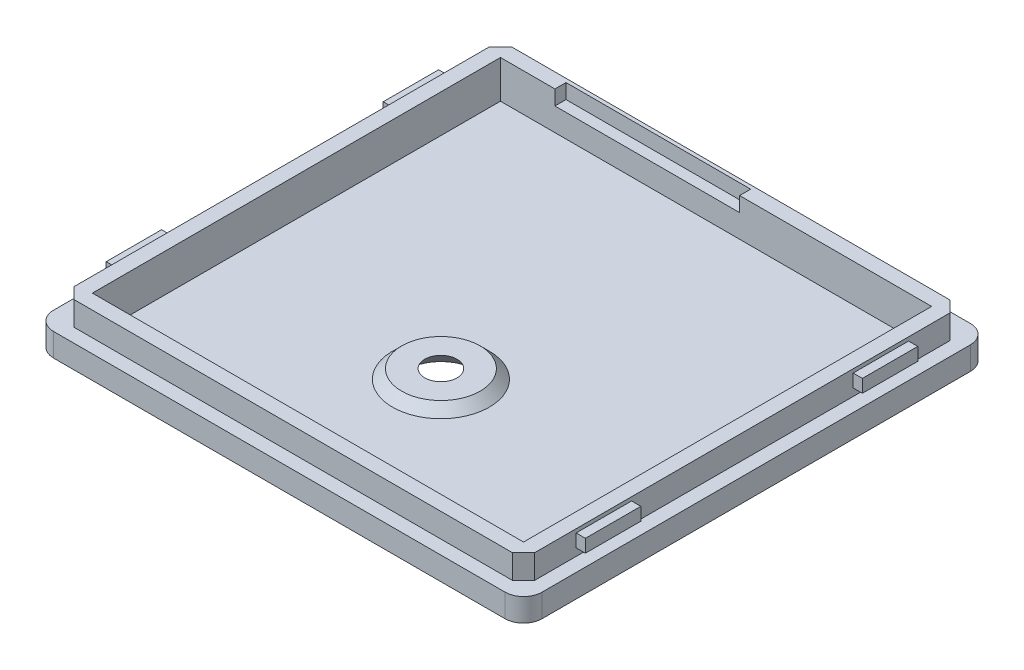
ISO-10303-21;
HEADER;
FILE_DESCRIPTION(('STEP AP214'),'2;1');
FILE_NAME('part.step','',(''),(''),'','','');
FILE_SCHEMA(('AUTOMOTIVE_DESIGN { 1 0 10303 214 1 1 1 1 }'));
ENDSEC;
DATA;
#1=APPLICATION_CONTEXT('core data for automotive mechanical design processes');
#2=APPLICATION_PROTOCOL_DEFINITION('international standard','automotive_design',2000,#1);
#3=PRODUCT_CONTEXT('',#1,'mechanical');
#4=PRODUCT('Part','Part','',(#3));
#5=PRODUCT_RELATED_PRODUCT_CATEGORY('part','',(#4));
#6=PRODUCT_DEFINITION_FORMATION('','',#4);
#7=PRODUCT_DEFINITION_CONTEXT('part definition',#1,'design');
#8=PRODUCT_DEFINITION('design','',#6,#7);
#9=PRODUCT_DEFINITION_SHAPE('','',#8);
#10=(LENGTH_UNIT() NAMED_UNIT(*) SI_UNIT(.MILLI.,.METRE.));
#11=(NAMED_UNIT(*) PLANE_ANGLE_UNIT() SI_UNIT($,.RADIAN.));
#12=(NAMED_UNIT(*) SI_UNIT($,.STERADIAN.) SOLID_ANGLE_UNIT());
#13=UNCERTAINTY_MEASURE_WITH_UNIT(LENGTH_MEASURE(1.E-05),#10,'distance_accuracy_value','');
#14=(GEOMETRIC_REPRESENTATION_CONTEXT(3) GLOBAL_UNCERTAINTY_ASSIGNED_CONTEXT((#13)) GLOBAL_UNIT_ASSIGNED_CONTEXT((#10,
#11,#12)) REPRESENTATION_CONTEXT('',''));
#15=CARTESIAN_POINT('',(0.,0.,0.));
#16=DIRECTION('',(0.,0.,1.));
#17=DIRECTION('',(1.,0.,0.));
#18=AXIS2_PLACEMENT_3D('',#15,#16,#17);
#19=CARTESIAN_POINT('',(-24.95,-70.565518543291,-23.2));
#20=DIRECTION('',(-1.,0.,0.));
#21=DIRECTION('',(0.,0.,1.));
#22=AXIS2_PLACEMENT_3D('',#19,#20,#21);
#23=PLANE('',#22);
#24=DIRECTION('',(0.,1.,0.));
#25=VECTOR('',#24,1.);
#26=CARTESIAN_POINT('',(-24.95,0.802943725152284,22.5));
#27=LINE('',#26,#25);
#28=CARTESIAN_POINT('',(-24.95,2.5,22.5));
#29=VERTEX_POINT('',#28);
#30=CARTESIAN_POINT('',(-24.95,5.1,22.5));
#31=VERTEX_POINT('',#30);
#32=EDGE_CURVE('E1050',#29,#31,#27,.T.);
#33=ORIENTED_EDGE('',*,*,#32,.T.);
#34=DIRECTION('',(0.,0.,1.));
#35=VECTOR('',#34,1.);
#36=CARTESIAN_POINT('',(-24.95,5.1,-23.2));
#37=LINE('',#36,#35);
#38=CARTESIAN_POINT('',(-24.95,5.1,-22.5));
#39=VERTEX_POINT('',#38);
#40=EDGE_CURVE('E1037',#39,#31,#37,.T.);
#41=ORIENTED_EDGE('',*,*,#40,.F.);
#42=DIRECTION('',(0.,1.,0.));
#43=VECTOR('',#42,1.);
#44=CARTESIAN_POINT('',(-24.95,0.802943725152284,-22.5));
#45=LINE('',#44,#43);
#46=CARTESIAN_POINT('',(-24.95,2.5,-22.5));
#47=VERTEX_POINT('',#46);
#48=EDGE_CURVE('E929',#47,#39,#45,.T.);
#49=ORIENTED_EDGE('',*,*,#48,.F.);
#50=DIRECTION('',(0.,0.,1.));
#51=VECTOR('',#50,1.);
#52=CARTESIAN_POINT('',(-24.95,2.5,-23.2));
#53=LINE('',#52,#51);
#54=EDGE_CURVE('E326',#47,#29,#53,.T.);
#55=ORIENTED_EDGE('',*,*,#54,.T.);
#56=EDGE_LOOP('',(#33,#41,#49,#55));
#57=FACE_BOUND('',#56,.T.);
#58=DIRECTION('',(0.,0.,-1.));
#59=VECTOR('',#58,1.);
#60=CARTESIAN_POINT('',(-24.95,4.7,-18.));
#61=LINE('',#60,#59);
#62=CARTESIAN_POINT('',(-24.95,4.7,-12.));
#63=VERTEX_POINT('',#62);
#64=CARTESIAN_POINT('',(-24.95,4.7,-18.));
#65=VERTEX_POINT('',#64);
#66=EDGE_CURVE('E1015',#63,#65,#61,.T.);
#67=ORIENTED_EDGE('',*,*,#66,.F.);
#68=DIRECTION('',(0.,1.,0.));
#69=VECTOR('',#68,1.);
#70=CARTESIAN_POINT('',(-24.95,3.3,-12.));
#71=LINE('',#70,#69);
#72=CARTESIAN_POINT('',(-24.95,3.3,-12.));
#73=VERTEX_POINT('',#72);
#74=EDGE_CURVE('E1001',#73,#63,#71,.T.);
#75=ORIENTED_EDGE('',*,*,#74,.F.);
#76=DIRECTION('',(0.,0.,1.));
#77=VECTOR('',#76,1.);
#78=CARTESIAN_POINT('',(-24.95,3.3,-18.));
#79=LINE('',#78,#77);
#80=CARTESIAN_POINT('',(-24.95,3.3,-18.));
#81=VERTEX_POINT('',#80);
#82=EDGE_CURVE('E1006',#81,#73,#79,.T.);
#83=ORIENTED_EDGE('',*,*,#82,.F.);
#84=DIRECTION('',(0.,-1.,0.));
#85=VECTOR('',#84,1.);
#86=CARTESIAN_POINT('',(-24.95,3.3,-18.));
#87=LINE('',#86,#85);
#88=EDGE_CURVE('E1017',#65,#81,#87,.T.);
#89=ORIENTED_EDGE('',*,*,#88,.F.);
#90=EDGE_LOOP('',(#67,#75,#83,#89));
#91=FACE_BOUND('',#90,.T.);
#92=DIRECTION('',(0.,0.,-1.));
#93=VECTOR('',#92,1.);
#94=CARTESIAN_POINT('',(-24.95,4.7,18.));
#95=LINE('',#94,#93);
#96=CARTESIAN_POINT('',(-24.95,4.7,18.));
#97=VERTEX_POINT('',#96);
#98=CARTESIAN_POINT('',(-24.95,4.7,12.));
#99=VERTEX_POINT('',#98);
#100=EDGE_CURVE('E986',#97,#99,#95,.T.);
#101=ORIENTED_EDGE('',*,*,#100,.F.);
#102=DIRECTION('',(0.,1.,0.));
#103=VECTOR('',#102,1.);
#104=CARTESIAN_POINT('',(-24.95,3.3,18.));
#105=LINE('',#104,#103);
#106=CARTESIAN_POINT('',(-24.95,3.3,18.));
#107=VERTEX_POINT('',#106);
#108=EDGE_CURVE('E972',#107,#97,#105,.T.);
#109=ORIENTED_EDGE('',*,*,#108,.F.);
#110=DIRECTION('',(0.,0.,1.));
#111=VECTOR('',#110,1.);
#112=CARTESIAN_POINT('',(-24.95,3.3,18.));
#113=LINE('',#112,#111);
#114=CARTESIAN_POINT('',(-24.95,3.3,12.));
#115=VERTEX_POINT('',#114);
#116=EDGE_CURVE('E977',#115,#107,#113,.T.);
#117=ORIENTED_EDGE('',*,*,#116,.F.);
#118=DIRECTION('',(0.,-1.,0.));
#119=VECTOR('',#118,1.);
#120=CARTESIAN_POINT('',(-24.95,3.3,12.));
#121=LINE('',#120,#119);
#122=EDGE_CURVE('E988',#99,#115,#121,.T.);
#123=ORIENTED_EDGE('',*,*,#122,.F.);
#124=EDGE_LOOP('',(#101,#109,#117,#123));
#125=FACE_BOUND('',#124,.T.);
#126=ADVANCED_FACE('F39',(#57,#91,#125),#23,.T.);
#127=CARTESIAN_POINT('',(24.45,5.1,-23.2));
#128=DIRECTION('',(0.,1.,0.));
#129=DIRECTION('',(0.,0.,1.));
#130=AXIS2_PLACEMENT_3D('',#127,#128,#129);
#131=PLANE('',#130);
#132=DIRECTION('',(-0.707106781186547,0.,-0.707106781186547));
#133=VECTOR('',#132,1.);
#134=CARTESIAN_POINT('',(-24.95,5.1,22.5));
#135=LINE('',#134,#133);
#136=CARTESIAN_POINT('',(-23.75,5.1,23.7));
#137=VERTEX_POINT('',#136);
#138=EDGE_CURVE('E1056',#137,#31,#135,.T.);
#139=ORIENTED_EDGE('',*,*,#138,.F.);
#140=DIRECTION('',(1.,0.,0.));
#141=VECTOR('',#140,1.);
#142=CARTESIAN_POINT('',(-24.45,5.1,23.7));
#143=LINE('',#142,#141);
#144=CARTESIAN_POINT('',(23.75,5.1,23.7));
#145=VERTEX_POINT('',#144);
#146=EDGE_CURVE('E1035',#137,#145,#143,.T.);
#147=ORIENTED_EDGE('',*,*,#146,.T.);
#148=DIRECTION('',(-0.707106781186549,0.,0.707106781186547));
#149=VECTOR('',#148,1.);
#150=CARTESIAN_POINT('',(23.75,5.1,23.7));
#151=LINE('',#150,#149);
#152=CARTESIAN_POINT('',(24.95,5.1,22.5));
#153=VERTEX_POINT('',#152);
#154=EDGE_CURVE('E1047',#153,#145,#151,.T.);
#155=ORIENTED_EDGE('',*,*,#154,.F.);
#156=DIRECTION('',(0.,0.,-1.));
#157=VECTOR('',#156,1.);
#158=CARTESIAN_POINT('',(24.95,5.1,23.2));
#159=LINE('',#158,#157);
#160=CARTESIAN_POINT('',(24.95,5.1,-22.5));
#161=VERTEX_POINT('',#160);
#162=EDGE_CURVE('E1033',#153,#161,#159,.T.);
#163=ORIENTED_EDGE('',*,*,#162,.T.);
#164=DIRECTION('',(0.707106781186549,0.,0.707106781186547));
#165=VECTOR('',#164,1.);
#166=CARTESIAN_POINT('',(23.75,5.1,-23.7));
#167=LINE('',#166,#165);
#168=CARTESIAN_POINT('',(23.75,5.1,-23.7));
#169=VERTEX_POINT('',#168);
#170=EDGE_CURVE('E62',#169,#161,#167,.T.);
#171=ORIENTED_EDGE('',*,*,#170,.F.);
#172=DIRECTION('',(-1.,0.,0.));
#173=VECTOR('',#172,1.);
#174=CARTESIAN_POINT('',(24.45,5.1,-23.7));
#175=LINE('',#174,#173);
#176=CARTESIAN_POINT('',(-23.75,5.1,-23.7));
#177=VERTEX_POINT('',#176);
#178=EDGE_CURVE('E1030',#169,#177,#175,.T.);
#179=ORIENTED_EDGE('',*,*,#178,.T.);
#180=DIRECTION('',(0.707106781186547,0.,-0.707106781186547));
#181=VECTOR('',#180,1.);
#182=CARTESIAN_POINT('',(-24.95,5.1,-22.5));
#183=LINE('',#182,#181);
#184=EDGE_CURVE('E54',#39,#177,#183,.T.);
#185=ORIENTED_EDGE('',*,*,#184,.F.);
#186=ORIENTED_EDGE('',*,*,#40,.T.);
#187=EDGE_LOOP('',(#139,#147,#155,#163,#171,#179,#185,#186));
#188=FACE_BOUND('',#187,.T.);
#189=DIRECTION('',(0.,0.,-1.));
#190=VECTOR('',#189,1.);
#191=CARTESIAN_POINT('',(2.55000000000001,5.1,-22.1));
#192=LINE('',#191,#190);
#193=CARTESIAN_POINT('',(2.55000000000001,5.1,-22.1));
#194=VERTEX_POINT('',#193);
#195=CARTESIAN_POINT('',(2.55000000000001,5.1,-23.3));
#196=VERTEX_POINT('',#195);
#197=EDGE_CURVE('E323',#194,#196,#192,.T.);
#198=ORIENTED_EDGE('',*,*,#197,.F.);
#199=DIRECTION('',(-1.,0.,0.));
#200=VECTOR('',#199,1.);
#201=CARTESIAN_POINT('',(23.35,5.1,-22.1));
#202=LINE('',#201,#200);
#203=CARTESIAN_POINT('',(23.35,5.1,-22.1));
#204=VERTEX_POINT('',#203);
#205=EDGE_CURVE('E363',#204,#194,#202,.T.);
#206=ORIENTED_EDGE('',*,*,#205,.F.);
#207=DIRECTION('',(0.,0.,-1.));
#208=VECTOR('',#207,1.);
#209=CARTESIAN_POINT('',(23.35,5.1,22.1));
#210=LINE('',#209,#208);
#211=CARTESIAN_POINT('',(23.35,5.1,22.1));
#212=VERTEX_POINT('',#211);
#213=EDGE_CURVE('E359',#212,#204,#210,.T.);
#214=ORIENTED_EDGE('',*,*,#213,.F.);
#215=DIRECTION('',(1.,0.,0.));
#216=VECTOR('',#215,1.);
#217=CARTESIAN_POINT('',(-23.35,5.1,22.1));
#218=LINE('',#217,#216);
#219=CARTESIAN_POINT('',(-23.35,5.1,22.1));
#220=VERTEX_POINT('',#219);
#221=EDGE_CURVE('E369',#220,#212,#218,.T.);
#222=ORIENTED_EDGE('',*,*,#221,.F.);
#223=DIRECTION('',(0.,0.,1.));
#224=VECTOR('',#223,1.);
#225=CARTESIAN_POINT('',(-23.35,5.1,-22.1));
#226=LINE('',#225,#224);
#227=CARTESIAN_POINT('',(-23.35,5.1,-22.1));
#228=VERTEX_POINT('',#227);
#229=EDGE_CURVE('E366',#228,#220,#226,.T.);
#230=ORIENTED_EDGE('',*,*,#229,.F.);
#231=CARTESIAN_POINT('',(-17.45,5.1,-22.1));
#232=VERTEX_POINT('',#231);
#233=EDGE_CURVE('E361',#232,#228,#202,.T.);
#234=ORIENTED_EDGE('',*,*,#233,.F.);
#235=DIRECTION('',(0.,0.,1.));
#236=VECTOR('',#235,1.);
#237=CARTESIAN_POINT('',(-17.45,5.1,-22.1));
#238=LINE('',#237,#236);
#239=CARTESIAN_POINT('',(-17.45,5.1,-23.3));
#240=VERTEX_POINT('',#239);
#241=EDGE_CURVE('E320',#240,#232,#238,.T.);
#242=ORIENTED_EDGE('',*,*,#241,.F.);
#243=DIRECTION('',(-1.,0.,0.));
#244=VECTOR('',#243,1.);
#245=CARTESIAN_POINT('',(-17.45,5.1,-23.3));
#246=LINE('',#245,#244);
#247=EDGE_CURVE('E333',#196,#240,#246,.T.);
#248=ORIENTED_EDGE('',*,*,#247,.F.);
#249=EDGE_LOOP('',(#198,#206,#214,#222,#230,#234,#242,#248));
#250=FACE_BOUND('',#249,.T.);
#251=ADVANCED_FACE('F491',(#188,#250),#131,.T.);
#252=CARTESIAN_POINT('',(24.45,1.,-23.2));
#253=DIRECTION('',(0.,-1.,0.));
#254=DIRECTION('',(0.,0.,-1.));
#255=AXIS2_PLACEMENT_3D('',#252,#253,#254);
#256=PLANE('',#255);
#257=CARTESIAN_POINT('',(-0.500000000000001,1.,7.2));
#258=DIRECTION('',(0.,-1.,0.));
#259=DIRECTION('',(0.,0.,-1.));
#260=AXIS2_PLACEMENT_3D('',#257,#258,#259);
#261=CIRCLE('',#260,5.25000000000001);
#262=CARTESIAN_POINT('',(-0.500000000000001,1.,1.94999999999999));
#263=VERTEX_POINT('',#262);
#264=EDGE_CURVE('E47',#263,#263,#261,.T.);
#265=ORIENTED_EDGE('',*,*,#264,.T.);
#266=EDGE_LOOP('',(#265));
#267=FACE_BOUND('',#266,.T.);
#268=DIRECTION('',(1.,0.,0.));
#269=VECTOR('',#268,1.);
#270=CARTESIAN_POINT('',(-23.35,1.,22.1));
#271=LINE('',#270,#269);
#272=CARTESIAN_POINT('',(-23.35,1.,22.1));
#273=VERTEX_POINT('',#272);
#274=CARTESIAN_POINT('',(23.35,1.,22.1));
#275=VERTEX_POINT('',#274);
#276=EDGE_CURVE('E362',#273,#275,#271,.T.);
#277=ORIENTED_EDGE('',*,*,#276,.T.);
#278=DIRECTION('',(0.,0.,-1.));
#279=VECTOR('',#278,1.);
#280=CARTESIAN_POINT('',(23.35,1.,22.1));
#281=LINE('',#280,#279);
#282=CARTESIAN_POINT('',(23.35,1.,-22.1));
#283=VERTEX_POINT('',#282);
#284=EDGE_CURVE('E358',#275,#283,#281,.T.);
#285=ORIENTED_EDGE('',*,*,#284,.T.);
#286=DIRECTION('',(-1.,0.,0.));
#287=VECTOR('',#286,1.);
#288=CARTESIAN_POINT('',(23.35,1.,-22.1));
#289=LINE('',#288,#287);
#290=CARTESIAN_POINT('',(-23.35,1.,-22.1));
#291=VERTEX_POINT('',#290);
#292=EDGE_CURVE('E374',#283,#291,#289,.T.);
#293=ORIENTED_EDGE('',*,*,#292,.T.);
#294=DIRECTION('',(0.,0.,1.));
#295=VECTOR('',#294,1.);
#296=CARTESIAN_POINT('',(-23.35,1.,-22.1));
#297=LINE('',#296,#295);
#298=EDGE_CURVE('E377',#291,#273,#297,.T.);
#299=ORIENTED_EDGE('',*,*,#298,.T.);
#300=EDGE_LOOP('',(#277,#285,#293,#299));
#301=FACE_BOUND('',#300,.T.);
#302=ADVANCED_FACE('F463',(#267,#301),#256,.F.);
#303=CARTESIAN_POINT('',(24.45,1.,-23.2));
#304=DIRECTION('',(0.,-1.,0.));
#305=DIRECTION('',(0.,0.,-1.));
#306=AXIS2_PLACEMENT_3D('',#303,#304,#305);
#307=CYLINDRICAL_SURFACE('',#306,2.);
#308=CARTESIAN_POINT('',(24.45,0.,-23.2));
#309=DIRECTION('',(0.,1.,0.));
#310=DIRECTION('',(0.,0.,-1.));
#311=AXIS2_PLACEMENT_3D('',#308,#309,#310);
#312=CIRCLE('',#311,2.);
#313=CARTESIAN_POINT('',(26.45,0.,-23.2));
#314=VERTEX_POINT('',#313);
#315=CARTESIAN_POINT('',(24.45,0.,-25.2));
#316=VERTEX_POINT('',#315);
#317=EDGE_CURVE('E414',#314,#316,#312,.T.);
#318=ORIENTED_EDGE('',*,*,#317,.T.);
#319=DIRECTION('',(0.,-1.,0.));
#320=VECTOR('',#319,1.);
#321=CARTESIAN_POINT('',(24.45,1.,-25.2));
#322=LINE('',#321,#320);
#323=CARTESIAN_POINT('',(24.45,2.5,-25.2));
#324=VERTEX_POINT('',#323);
#325=EDGE_CURVE('E452',#324,#316,#322,.T.);
#326=ORIENTED_EDGE('',*,*,#325,.F.);
#327=CARTESIAN_POINT('',(24.45,2.5,-23.2));
#328=DIRECTION('',(0.,-1.,0.));
#329=DIRECTION('',(0.,0.,-1.));
#330=AXIS2_PLACEMENT_3D('',#327,#328,#329);
#331=CIRCLE('',#330,2.);
#332=CARTESIAN_POINT('',(26.45,2.5,-23.2));
#333=VERTEX_POINT('',#332);
#334=EDGE_CURVE('E396',#324,#333,#331,.T.);
#335=ORIENTED_EDGE('',*,*,#334,.T.);
#336=DIRECTION('',(0.,-1.,0.));
#337=VECTOR('',#336,1.);
#338=CARTESIAN_POINT('',(26.45,1.,-23.2));
#339=LINE('',#338,#337);
#340=EDGE_CURVE('E431',#333,#314,#339,.T.);
#341=ORIENTED_EDGE('',*,*,#340,.T.);
#342=EDGE_LOOP('',(#318,#326,#335,#341));
#343=FACE_BOUND('',#342,.T.);
#344=ADVANCED_FACE('F548',(#343),#307,.T.);
#345=CARTESIAN_POINT('',(-24.45,1.,-25.2));
#346=DIRECTION('',(0.,0.,1.));
#347=DIRECTION('',(1.,0.,0.));
#348=AXIS2_PLACEMENT_3D('',#345,#346,#347);
#349=PLANE('',#348);
#350=DIRECTION('',(-1.,0.,0.));
#351=VECTOR('',#350,1.);
#352=CARTESIAN_POINT('',(-24.45,0.,-25.2));
#353=LINE('',#352,#351);
#354=CARTESIAN_POINT('',(-24.45,0.,-25.2));
#355=VERTEX_POINT('',#354);
#356=EDGE_CURVE('E417',#316,#355,#353,.T.);
#357=ORIENTED_EDGE('',*,*,#356,.T.);
#358=DIRECTION('',(0.,-1.,0.));
#359=VECTOR('',#358,1.);
#360=CARTESIAN_POINT('',(-24.45,1.,-25.2));
#361=LINE('',#360,#359);
#362=CARTESIAN_POINT('',(-24.45,2.5,-25.2));
#363=VERTEX_POINT('',#362);
#364=EDGE_CURVE('E449',#363,#355,#361,.T.);
#365=ORIENTED_EDGE('',*,*,#364,.F.);
#366=DIRECTION('',(1.,0.,0.));
#367=VECTOR('',#366,1.);
#368=CARTESIAN_POINT('',(-24.45,2.5,-25.2));
#369=LINE('',#368,#367);
#370=EDGE_CURVE('E393',#363,#324,#369,.T.);
#371=ORIENTED_EDGE('',*,*,#370,.T.);
#372=ORIENTED_EDGE('',*,*,#325,.T.);
#373=EDGE_LOOP('',(#357,#365,#371,#372));
#374=FACE_BOUND('',#373,.T.);
#375=ADVANCED_FACE('F575',(#374),#349,.F.);
#376=CARTESIAN_POINT('',(-24.45,1.,-23.2));
#377=DIRECTION('',(0.,-1.,0.));
#378=DIRECTION('',(0.,0.,-1.));
#379=AXIS2_PLACEMENT_3D('',#376,#377,#378);
#380=CYLINDRICAL_SURFACE('',#379,2.);
#381=CARTESIAN_POINT('',(-24.45,0.,-23.2));
#382=DIRECTION('',(0.,1.,0.));
#383=DIRECTION('',(0.,0.,-1.));
#384=AXIS2_PLACEMENT_3D('',#381,#382,#383);
#385=CIRCLE('',#384,2.);
#386=CARTESIAN_POINT('',(-26.45,0.,-23.2));
#387=VERTEX_POINT('',#386);
#388=EDGE_CURVE('E419',#355,#387,#385,.T.);
#389=ORIENTED_EDGE('',*,*,#388,.T.);
#390=DIRECTION('',(0.,-1.,0.));
#391=VECTOR('',#390,1.);
#392=CARTESIAN_POINT('',(-26.45,1.,-23.2));
#393=LINE('',#392,#391);
#394=CARTESIAN_POINT('',(-26.45,2.5,-23.2));
#395=VERTEX_POINT('',#394);
#396=EDGE_CURVE('E446',#395,#387,#393,.T.);
#397=ORIENTED_EDGE('',*,*,#396,.F.);
#398=CARTESIAN_POINT('',(-24.45,2.5,-23.2));
#399=DIRECTION('',(0.,-1.,0.));
#400=DIRECTION('',(0.,0.,-1.));
#401=AXIS2_PLACEMENT_3D('',#398,#399,#400);
#402=CIRCLE('',#401,2.);
#403=EDGE_CURVE('E390',#395,#363,#402,.T.);
#404=ORIENTED_EDGE('',*,*,#403,.T.);
#405=ORIENTED_EDGE('',*,*,#364,.T.);
#406=EDGE_LOOP('',(#389,#397,#404,#405));
#407=FACE_BOUND('',#406,.T.);
#408=ADVANCED_FACE('F571',(#407),#380,.T.);
#409=CARTESIAN_POINT('',(-26.45,1.,23.2));
#410=DIRECTION('',(1.,0.,0.));
#411=DIRECTION('',(0.,0.,-1.));
#412=AXIS2_PLACEMENT_3D('',#409,#410,#411);
#413=PLANE('',#412);
#414=DIRECTION('',(0.,0.,1.));
#415=VECTOR('',#414,1.);
#416=CARTESIAN_POINT('',(-26.45,0.,23.2));
#417=LINE('',#416,#415);
#418=CARTESIAN_POINT('',(-26.45,0.,23.2));
#419=VERTEX_POINT('',#418);
#420=EDGE_CURVE('E421',#387,#419,#417,.T.);
#421=ORIENTED_EDGE('',*,*,#420,.T.);
#422=DIRECTION('',(0.,-1.,0.));
#423=VECTOR('',#422,1.);
#424=CARTESIAN_POINT('',(-26.45,1.,23.2));
#425=LINE('',#424,#423);
#426=CARTESIAN_POINT('',(-26.45,2.5,23.2));
#427=VERTEX_POINT('',#426);
#428=EDGE_CURVE('E443',#427,#419,#425,.T.);
#429=ORIENTED_EDGE('',*,*,#428,.F.);
#430=DIRECTION('',(0.,0.,-1.));
#431=VECTOR('',#430,1.);
#432=CARTESIAN_POINT('',(-26.45,2.5,23.2));
#433=LINE('',#432,#431);
#434=EDGE_CURVE('E411',#427,#395,#433,.T.);
#435=ORIENTED_EDGE('',*,*,#434,.T.);
#436=ORIENTED_EDGE('',*,*,#396,.T.);
#437=EDGE_LOOP('',(#421,#429,#435,#436));
#438=FACE_BOUND('',#437,.T.);
#439=ADVANCED_FACE('F567',(#438),#413,.F.);
#440=CARTESIAN_POINT('',(-24.45,1.,23.2));
#441=DIRECTION('',(0.,-1.,0.));
#442=DIRECTION('',(0.,0.,-1.));
#443=AXIS2_PLACEMENT_3D('',#440,#441,#442);
#444=CYLINDRICAL_SURFACE('',#443,2.);
#445=CARTESIAN_POINT('',(-24.45,0.,23.2));
#446=DIRECTION('',(0.,1.,0.));
#447=DIRECTION('',(0.,0.,-1.));
#448=AXIS2_PLACEMENT_3D('',#445,#446,#447);
#449=CIRCLE('',#448,2.);
#450=CARTESIAN_POINT('',(-24.45,0.,25.2));
#451=VERTEX_POINT('',#450);
#452=EDGE_CURVE('E423',#419,#451,#449,.T.);
#453=ORIENTED_EDGE('',*,*,#452,.T.);
#454=DIRECTION('',(0.,-1.,0.));
#455=VECTOR('',#454,1.);
#456=CARTESIAN_POINT('',(-24.45,1.,25.2));
#457=LINE('',#456,#455);
#458=CARTESIAN_POINT('',(-24.45,2.5,25.2));
#459=VERTEX_POINT('',#458);
#460=EDGE_CURVE('E440',#459,#451,#457,.T.);
#461=ORIENTED_EDGE('',*,*,#460,.F.);
#462=CARTESIAN_POINT('',(-24.45,2.5,23.2));
#463=DIRECTION('',(0.,-1.,0.));
#464=DIRECTION('',(0.,0.,-1.));
#465=AXIS2_PLACEMENT_3D('',#462,#463,#464);
#466=CIRCLE('',#465,2.);
#467=EDGE_CURVE('E408',#459,#427,#466,.T.);
#468=ORIENTED_EDGE('',*,*,#467,.T.);
#469=ORIENTED_EDGE('',*,*,#428,.T.);
#470=EDGE_LOOP('',(#453,#461,#468,#469));
#471=FACE_BOUND('',#470,.T.);
#472=ADVANCED_FACE('F563',(#471),#444,.T.);
#473=CARTESIAN_POINT('',(-24.45,1.,25.2));
#474=DIRECTION('',(0.,0.,-1.));
#475=DIRECTION('',(-1.,0.,0.));
#476=AXIS2_PLACEMENT_3D('',#473,#474,#475);
#477=PLANE('',#476);
#478=DIRECTION('',(1.,0.,0.));
#479=VECTOR('',#478,1.);
#480=CARTESIAN_POINT('',(-24.45,0.,25.2));
#481=LINE('',#480,#479);
#482=CARTESIAN_POINT('',(24.45,0.,25.2));
#483=VERTEX_POINT('',#482);
#484=EDGE_CURVE('E425',#451,#483,#481,.T.);
#485=ORIENTED_EDGE('',*,*,#484,.T.);
#486=DIRECTION('',(0.,-1.,0.));
#487=VECTOR('',#486,1.);
#488=CARTESIAN_POINT('',(24.45,1.,25.2));
#489=LINE('',#488,#487);
#490=CARTESIAN_POINT('',(24.45,2.5,25.2));
#491=VERTEX_POINT('',#490);
#492=EDGE_CURVE('E437',#491,#483,#489,.T.);
#493=ORIENTED_EDGE('',*,*,#492,.F.);
#494=DIRECTION('',(-1.,0.,0.));
#495=VECTOR('',#494,1.);
#496=CARTESIAN_POINT('',(24.45,2.5,25.2));
#497=LINE('',#496,#495);
#498=EDGE_CURVE('E405',#491,#459,#497,.T.);
#499=ORIENTED_EDGE('',*,*,#498,.T.);
#500=ORIENTED_EDGE('',*,*,#460,.T.);
#501=EDGE_LOOP('',(#485,#493,#499,#500));
#502=FACE_BOUND('',#501,.T.);
#503=ADVANCED_FACE('F559',(#502),#477,.F.);
#504=CARTESIAN_POINT('',(24.45,1.,23.2));
#505=DIRECTION('',(0.,-1.,0.));
#506=DIRECTION('',(0.,0.,-1.));
#507=AXIS2_PLACEMENT_3D('',#504,#505,#506);
#508=CYLINDRICAL_SURFACE('',#507,2.);
#509=CARTESIAN_POINT('',(24.45,0.,23.2));
#510=DIRECTION('',(0.,1.,0.));
#511=DIRECTION('',(0.,0.,1.));
#512=AXIS2_PLACEMENT_3D('',#509,#510,#511);
#513=CIRCLE('',#512,2.);
#514=CARTESIAN_POINT('',(26.45,0.,23.2));
#515=VERTEX_POINT('',#514);
#516=EDGE_CURVE('E427',#483,#515,#513,.T.);
#517=ORIENTED_EDGE('',*,*,#516,.T.);
#518=DIRECTION('',(0.,-1.,0.));
#519=VECTOR('',#518,1.);
#520=CARTESIAN_POINT('',(26.45,1.,23.2));
#521=LINE('',#520,#519);
#522=CARTESIAN_POINT('',(26.45,2.5,23.2));
#523=VERTEX_POINT('',#522);
#524=EDGE_CURVE('E434',#523,#515,#521,.T.);
#525=ORIENTED_EDGE('',*,*,#524,.F.);
#526=CARTESIAN_POINT('',(24.45,2.5,23.2));
#527=DIRECTION('',(0.,-1.,0.));
#528=DIRECTION('',(0.,0.,-1.));
#529=AXIS2_PLACEMENT_3D('',#526,#527,#528);
#530=CIRCLE('',#529,2.);
#531=EDGE_CURVE('E402',#523,#491,#530,.T.);
#532=ORIENTED_EDGE('',*,*,#531,.T.);
#533=ORIENTED_EDGE('',*,*,#492,.T.);
#534=EDGE_LOOP('',(#517,#525,#532,#533));
#535=FACE_BOUND('',#534,.T.);
#536=ADVANCED_FACE('F555',(#535),#508,.T.);
#537=CARTESIAN_POINT('',(26.45,1.,23.2));
#538=DIRECTION('',(-1.,0.,0.));
#539=DIRECTION('',(0.,0.,1.));
#540=AXIS2_PLACEMENT_3D('',#537,#538,#539);
#541=PLANE('',#540);
#542=DIRECTION('',(0.,0.,-1.));
#543=VECTOR('',#542,1.);
#544=CARTESIAN_POINT('',(26.45,0.,23.2));
#545=LINE('',#544,#543);
#546=EDGE_CURVE('E429',#515,#314,#545,.T.);
#547=ORIENTED_EDGE('',*,*,#546,.T.);
#548=ORIENTED_EDGE('',*,*,#340,.F.);
#549=DIRECTION('',(0.,0.,1.));
#550=VECTOR('',#549,1.);
#551=CARTESIAN_POINT('',(26.45,2.5,-23.2));
#552=LINE('',#551,#550);
#553=EDGE_CURVE('E399',#333,#523,#552,.T.);
#554=ORIENTED_EDGE('',*,*,#553,.T.);
#555=ORIENTED_EDGE('',*,*,#524,.T.);
#556=EDGE_LOOP('',(#547,#548,#554,#555));
#557=FACE_BOUND('',#556,.T.);
#558=ADVANCED_FACE('F551',(#557),#541,.F.);
#559=CARTESIAN_POINT('',(24.45,0.,-23.2));
#560=DIRECTION('',(0.,-1.,0.));
#561=DIRECTION('',(0.,0.,-1.));
#562=AXIS2_PLACEMENT_3D('',#559,#560,#561);
#563=PLANE('',#562);
#564=CARTESIAN_POINT('',(-0.500000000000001,0.,7.2));
#565=DIRECTION('',(0.,-1.,0.));
#566=DIRECTION('',(0.,0.,-1.));
#567=AXIS2_PLACEMENT_3D('',#564,#565,#566);
#568=CIRCLE('',#567,3.75000000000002);
#569=CARTESIAN_POINT('',(-0.500000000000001,0.,3.44999999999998));
#570=VERTEX_POINT('',#569);
#571=EDGE_CURVE('E458',#570,#570,#568,.F.);
#572=ORIENTED_EDGE('',*,*,#571,.T.);
#573=EDGE_LOOP('',(#572));
#574=FACE_BOUND('',#573,.T.);
#575=ORIENTED_EDGE('',*,*,#317,.F.);
#576=ORIENTED_EDGE('',*,*,#546,.F.);
#577=ORIENTED_EDGE('',*,*,#516,.F.);
#578=ORIENTED_EDGE('',*,*,#484,.F.);
#579=ORIENTED_EDGE('',*,*,#452,.F.);
#580=ORIENTED_EDGE('',*,*,#420,.F.);
#581=ORIENTED_EDGE('',*,*,#388,.F.);
#582=ORIENTED_EDGE('',*,*,#356,.F.);
#583=EDGE_LOOP('',(#575,#576,#577,#578,#579,#580,#581,#582));
#584=FACE_BOUND('',#583,.T.);
#585=ADVANCED_FACE('F545',(#574,#584),#563,.T.);
#586=CARTESIAN_POINT('',(-24.45,2.5,-23.2));
#587=DIRECTION('',(0.,-1.,0.));
#588=DIRECTION('',(0.,0.,-1.));
#589=AXIS2_PLACEMENT_3D('',#586,#587,#588);
#590=PLANE('',#589);
#591=ORIENTED_EDGE('',*,*,#54,.F.);
#592=DIRECTION('',(0.707106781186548,0.,-0.707106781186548));
#593=VECTOR('',#592,1.);
#594=CARTESIAN_POINT('',(-24.95,2.5,-22.5));
#595=LINE('',#594,#593);
#596=CARTESIAN_POINT('',(-23.75,2.5,-23.7));
#597=VERTEX_POINT('',#596);
#598=EDGE_CURVE('E1044',#47,#597,#595,.T.);
#599=ORIENTED_EDGE('',*,*,#598,.T.);
#600=DIRECTION('',(-1.,0.,0.));
#601=VECTOR('',#600,1.);
#602=CARTESIAN_POINT('',(24.45,2.5,-23.7));
#603=LINE('',#602,#601);
#604=CARTESIAN_POINT('',(23.75,2.5,-23.7));
#605=VERTEX_POINT('',#604);
#606=EDGE_CURVE('E314',#605,#597,#603,.T.);
#607=ORIENTED_EDGE('',*,*,#606,.F.);
#608=DIRECTION('',(0.707106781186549,0.,0.707106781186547));
#609=VECTOR('',#608,1.);
#610=CARTESIAN_POINT('',(23.75,2.5,-23.7));
#611=LINE('',#610,#609);
#612=CARTESIAN_POINT('',(24.95,2.5,-22.5));
#613=VERTEX_POINT('',#612);
#614=EDGE_CURVE('E296',#605,#613,#611,.T.);
#615=ORIENTED_EDGE('',*,*,#614,.T.);
#616=DIRECTION('',(0.,0.,-1.));
#617=VECTOR('',#616,1.);
#618=CARTESIAN_POINT('',(24.95,2.5,23.2));
#619=LINE('',#618,#617);
#620=CARTESIAN_POINT('',(24.95,2.5,22.5));
#621=VERTEX_POINT('',#620);
#622=EDGE_CURVE('E311',#621,#613,#619,.T.);
#623=ORIENTED_EDGE('',*,*,#622,.F.);
#624=DIRECTION('',(-0.707106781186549,0.,0.707106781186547));
#625=VECTOR('',#624,1.);
#626=CARTESIAN_POINT('',(23.75,2.5,23.7));
#627=LINE('',#626,#625);
#628=CARTESIAN_POINT('',(23.75,2.5,23.7));
#629=VERTEX_POINT('',#628);
#630=EDGE_CURVE('E1049',#621,#629,#627,.T.);
#631=ORIENTED_EDGE('',*,*,#630,.T.);
#632=DIRECTION('',(1.,0.,0.));
#633=VECTOR('',#632,1.);
#634=CARTESIAN_POINT('',(-24.45,2.5,23.7));
#635=LINE('',#634,#633);
#636=CARTESIAN_POINT('',(-23.75,2.5,23.7));
#637=VERTEX_POINT('',#636);
#638=EDGE_CURVE('E321',#637,#629,#635,.T.);
#639=ORIENTED_EDGE('',*,*,#638,.F.);
#640=DIRECTION('',(-0.707106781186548,0.,-0.707106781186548));
#641=VECTOR('',#640,1.);
#642=CARTESIAN_POINT('',(-24.95,2.5,22.5));
#643=LINE('',#642,#641);
#644=EDGE_CURVE('E1059',#637,#29,#643,.T.);
#645=ORIENTED_EDGE('',*,*,#644,.T.);
#646=EDGE_LOOP('',(#591,#599,#607,#615,#623,#631,#639,#645));
#647=FACE_BOUND('',#646,.T.);
#648=ORIENTED_EDGE('',*,*,#403,.F.);
#649=ORIENTED_EDGE('',*,*,#434,.F.);
#650=ORIENTED_EDGE('',*,*,#467,.F.);
#651=ORIENTED_EDGE('',*,*,#498,.F.);
#652=ORIENTED_EDGE('',*,*,#531,.F.);
#653=ORIENTED_EDGE('',*,*,#553,.F.);
#654=ORIENTED_EDGE('',*,*,#334,.F.);
#655=ORIENTED_EDGE('',*,*,#370,.F.);
#656=EDGE_LOOP('',(#648,#649,#650,#651,#652,#653,#654,#655));
#657=FACE_BOUND('',#656,.T.);
#658=ADVANCED_FACE('F308',(#647,#657),#590,.F.);
#659=CARTESIAN_POINT('',(-0.500000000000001,2.,7.2));
#660=DIRECTION('',(0.,1.,0.));
#661=DIRECTION('',(0.,0.,1.));
#662=AXIS2_PLACEMENT_3D('',#659,#660,#661);
#663=PLANE('',#662);
#664=CARTESIAN_POINT('',(-0.500000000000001,2.,7.2));
#665=DIRECTION('',(0.,1.,0.));
#666=DIRECTION('',(0.,0.,1.));
#667=AXIS2_PLACEMENT_3D('',#664,#665,#666);
#668=CIRCLE('',#667,4.25000000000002);
#669=CARTESIAN_POINT('',(-0.500000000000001,2.,11.45));
#670=VERTEX_POINT('',#669);
#671=EDGE_CURVE('E13',#670,#670,#668,.T.);
#672=ORIENTED_EDGE('',*,*,#671,.T.);
#673=EDGE_LOOP('',(#672));
#674=FACE_BOUND('',#673,.T.);
#675=CARTESIAN_POINT('',(-0.500000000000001,2.,7.2));
#676=DIRECTION('',(0.,1.,0.));
#677=DIRECTION('',(0.,0.,1.));
#678=AXIS2_PLACEMENT_3D('',#675,#676,#677);
#679=CIRCLE('',#678,1.75000000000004);
#680=CARTESIAN_POINT('',(-0.500000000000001,2.,8.95000000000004));
#681=VERTEX_POINT('',#680);
#682=EDGE_CURVE('E455',#681,#681,#679,.F.);
#683=ORIENTED_EDGE('',*,*,#682,.T.);
#684=EDGE_LOOP('',(#683));
#685=FACE_BOUND('',#684,.T.);
#686=ADVANCED_FACE('F472',(#674,#685),#663,.T.);
#687=CARTESIAN_POINT('',(-0.500000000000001,2.50000000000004,7.2));
#688=DIRECTION('',(0.,-1.,0.));
#689=DIRECTION('',(0.,0.,-1.));
#690=AXIS2_PLACEMENT_3D('',#687,#688,#689);
#691=CONICAL_SURFACE('',#690,1.25,0.785398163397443);
#692=ORIENTED_EDGE('',*,*,#571,.F.);
#693=EDGE_LOOP('',(#692));
#694=FACE_BOUND('',#693,.T.);
#695=ORIENTED_EDGE('',*,*,#682,.F.);
#696=EDGE_LOOP('',(#695));
#697=FACE_BOUND('',#696,.T.);
#698=ADVANCED_FACE('F475',(#694,#697),#691,.F.);
#699=CARTESIAN_POINT('',(23.35,5.1,22.1));
#700=DIRECTION('',(-1.,0.,0.));
#701=DIRECTION('',(0.,0.,1.));
#702=AXIS2_PLACEMENT_3D('',#699,#700,#701);
#703=PLANE('',#702);
#704=ORIENTED_EDGE('',*,*,#284,.F.);
#705=DIRECTION('',(0.,-1.,0.));
#706=VECTOR('',#705,1.);
#707=CARTESIAN_POINT('',(23.35,5.1,22.1));
#708=LINE('',#707,#706);
#709=EDGE_CURVE('E371',#212,#275,#708,.T.);
#710=ORIENTED_EDGE('',*,*,#709,.F.);
#711=ORIENTED_EDGE('',*,*,#213,.T.);
#712=DIRECTION('',(0.,-1.,0.));
#713=VECTOR('',#712,1.);
#714=CARTESIAN_POINT('',(23.35,5.1,-22.1));
#715=LINE('',#714,#713);
#716=EDGE_CURVE('E387',#204,#283,#715,.T.);
#717=ORIENTED_EDGE('',*,*,#716,.T.);
#718=EDGE_LOOP('',(#704,#710,#711,#717));
#719=FACE_BOUND('',#718,.T.);
#720=ADVANCED_FACE('F480',(#719),#703,.T.);
#721=CARTESIAN_POINT('',(23.35,5.1,-22.1));
#722=DIRECTION('',(0.,0.,1.));
#723=DIRECTION('',(1.,0.,0.));
#724=AXIS2_PLACEMENT_3D('',#721,#722,#723);
#725=PLANE('',#724);
#726=DIRECTION('',(0.,1.,0.));
#727=VECTOR('',#726,1.);
#728=CARTESIAN_POINT('',(2.55000000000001,-17.5359676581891,-22.1));
#729=LINE('',#728,#727);
#730=CARTESIAN_POINT('',(2.55000000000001,3.5,-22.1));
#731=VERTEX_POINT('',#730);
#732=EDGE_CURVE('E341',#731,#194,#729,.T.);
#733=ORIENTED_EDGE('',*,*,#732,.F.);
#734=DIRECTION('',(1.,0.,0.));
#735=VECTOR('',#734,1.);
#736=CARTESIAN_POINT('',(-17.45,3.5,-22.1));
#737=LINE('',#736,#735);
#738=CARTESIAN_POINT('',(-17.45,3.5,-22.1));
#739=VERTEX_POINT('',#738);
#740=EDGE_CURVE('E336',#739,#731,#737,.T.);
#741=ORIENTED_EDGE('',*,*,#740,.F.);
#742=DIRECTION('',(0.,1.,0.));
#743=VECTOR('',#742,1.);
#744=CARTESIAN_POINT('',(-17.45,-17.5359676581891,-22.1));
#745=LINE('',#744,#743);
#746=EDGE_CURVE('E344',#739,#232,#745,.T.);
#747=ORIENTED_EDGE('',*,*,#746,.T.);
#748=ORIENTED_EDGE('',*,*,#233,.T.);
#749=DIRECTION('',(0.,-1.,0.));
#750=VECTOR('',#749,1.);
#751=CARTESIAN_POINT('',(-23.35,5.1,-22.1));
#752=LINE('',#751,#750);
#753=EDGE_CURVE('E385',#228,#291,#752,.T.);
#754=ORIENTED_EDGE('',*,*,#753,.T.);
#755=ORIENTED_EDGE('',*,*,#292,.F.);
#756=ORIENTED_EDGE('',*,*,#716,.F.);
#757=ORIENTED_EDGE('',*,*,#205,.T.);
#758=EDGE_LOOP('',(#733,#741,#747,#748,#754,#755,#756,#757));
#759=FACE_BOUND('',#758,.T.);
#760=ADVANCED_FACE('F485',(#759),#725,.T.);
#761=CARTESIAN_POINT('',(-23.35,5.1,-22.1));
#762=DIRECTION('',(1.,0.,0.));
#763=DIRECTION('',(0.,0.,-1.));
#764=AXIS2_PLACEMENT_3D('',#761,#762,#763);
#765=PLANE('',#764);
#766=ORIENTED_EDGE('',*,*,#298,.F.);
#767=ORIENTED_EDGE('',*,*,#753,.F.);
#768=ORIENTED_EDGE('',*,*,#229,.T.);
#769=DIRECTION('',(0.,-1.,0.));
#770=VECTOR('',#769,1.);
#771=CARTESIAN_POINT('',(-23.35,5.1,22.1));
#772=LINE('',#771,#770);
#773=EDGE_CURVE('E383',#220,#273,#772,.T.);
#774=ORIENTED_EDGE('',*,*,#773,.T.);
#775=EDGE_LOOP('',(#766,#767,#768,#774));
#776=FACE_BOUND('',#775,.T.);
#777=ADVANCED_FACE('F535',(#776),#765,.T.);
#778=CARTESIAN_POINT('',(-23.35,5.1,22.1));
#779=DIRECTION('',(0.,0.,-1.));
#780=DIRECTION('',(-1.,0.,0.));
#781=AXIS2_PLACEMENT_3D('',#778,#779,#780);
#782=PLANE('',#781);
#783=ORIENTED_EDGE('',*,*,#276,.F.);
#784=ORIENTED_EDGE('',*,*,#773,.F.);
#785=ORIENTED_EDGE('',*,*,#221,.T.);
#786=ORIENTED_EDGE('',*,*,#709,.T.);
#787=EDGE_LOOP('',(#783,#784,#785,#786));
#788=FACE_BOUND('',#787,.T.);
#789=ADVANCED_FACE('F531',(#788),#782,.T.);
#790=CARTESIAN_POINT('',(-24.45,3.5,-23.2));
#791=DIRECTION('',(0.,-1.,0.));
#792=DIRECTION('',(0.,0.,-1.));
#793=AXIS2_PLACEMENT_3D('',#790,#791,#792);
#794=PLANE('',#793);
#795=DIRECTION('',(0.,0.,1.));
#796=VECTOR('',#795,1.);
#797=CARTESIAN_POINT('',(-17.45,3.5,-22.1));
#798=LINE('',#797,#796);
#799=CARTESIAN_POINT('',(-17.45,3.5,-23.3));
#800=VERTEX_POINT('',#799);
#801=EDGE_CURVE('E342',#800,#739,#798,.T.);
#802=ORIENTED_EDGE('',*,*,#801,.T.);
#803=ORIENTED_EDGE('',*,*,#740,.T.);
#804=DIRECTION('',(0.,0.,-1.));
#805=VECTOR('',#804,1.);
#806=CARTESIAN_POINT('',(2.55000000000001,3.5,-22.1));
#807=LINE('',#806,#805);
#808=CARTESIAN_POINT('',(2.55000000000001,3.5,-23.3));
#809=VERTEX_POINT('',#808);
#810=EDGE_CURVE('E350',#731,#809,#807,.T.);
#811=ORIENTED_EDGE('',*,*,#810,.T.);
#812=DIRECTION('',(-1.,0.,0.));
#813=VECTOR('',#812,1.);
#814=CARTESIAN_POINT('',(-17.45,3.5,-23.3));
#815=LINE('',#814,#813);
#816=EDGE_CURVE('E346',#809,#800,#815,.T.);
#817=ORIENTED_EDGE('',*,*,#816,.T.);
#818=EDGE_LOOP('',(#802,#803,#811,#817));
#819=FACE_BOUND('',#818,.T.);
#820=ADVANCED_FACE('F527',(#819),#794,.F.);
#821=CARTESIAN_POINT('',(2.55000000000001,-17.5359676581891,-22.1));
#822=DIRECTION('',(1.,0.,0.));
#823=DIRECTION('',(0.,0.,-1.));
#824=AXIS2_PLACEMENT_3D('',#821,#822,#823);
#825=PLANE('',#824);
#826=ORIENTED_EDGE('',*,*,#732,.T.);
#827=ORIENTED_EDGE('',*,*,#197,.T.);
#828=DIRECTION('',(0.,1.,0.));
#829=VECTOR('',#828,1.);
#830=CARTESIAN_POINT('',(2.55000000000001,-17.5359676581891,-23.3));
#831=LINE('',#830,#829);
#832=EDGE_CURVE('E349',#809,#196,#831,.T.);
#833=ORIENTED_EDGE('',*,*,#832,.F.);
#834=ORIENTED_EDGE('',*,*,#810,.F.);
#835=EDGE_LOOP('',(#826,#827,#833,#834));
#836=FACE_BOUND('',#835,.T.);
#837=ADVANCED_FACE('F523',(#836),#825,.F.);
#838=CARTESIAN_POINT('',(-17.45,-17.5359676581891,-23.3));
#839=DIRECTION('',(0.,0.,-1.));
#840=DIRECTION('',(-1.,0.,0.));
#841=AXIS2_PLACEMENT_3D('',#838,#839,#840);
#842=PLANE('',#841);
#843=ORIENTED_EDGE('',*,*,#832,.T.);
#844=ORIENTED_EDGE('',*,*,#247,.T.);
#845=DIRECTION('',(0.,1.,0.));
#846=VECTOR('',#845,1.);
#847=CARTESIAN_POINT('',(-17.45,-17.5359676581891,-23.3));
#848=LINE('',#847,#846);
#849=EDGE_CURVE('E345',#800,#240,#848,.T.);
#850=ORIENTED_EDGE('',*,*,#849,.F.);
#851=ORIENTED_EDGE('',*,*,#816,.F.);
#852=EDGE_LOOP('',(#843,#844,#850,#851));
#853=FACE_BOUND('',#852,.T.);
#854=ADVANCED_FACE('F519',(#853),#842,.F.);
#855=CARTESIAN_POINT('',(-17.45,-17.5359676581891,-22.1));
#856=DIRECTION('',(-1.,0.,0.));
#857=DIRECTION('',(0.,0.,1.));
#858=AXIS2_PLACEMENT_3D('',#855,#856,#857);
#859=PLANE('',#858);
#860=ORIENTED_EDGE('',*,*,#849,.T.);
#861=ORIENTED_EDGE('',*,*,#241,.T.);
#862=ORIENTED_EDGE('',*,*,#746,.F.);
#863=ORIENTED_EDGE('',*,*,#801,.F.);
#864=EDGE_LOOP('',(#860,#861,#862,#863));
#865=FACE_BOUND('',#864,.T.);
#866=ADVANCED_FACE('F515',(#865),#859,.F.);
#867=CARTESIAN_POINT('',(24.45,-70.565518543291,-23.7));
#868=DIRECTION('',(0.,0.,-1.));
#869=DIRECTION('',(-1.,0.,0.));
#870=AXIS2_PLACEMENT_3D('',#867,#868,#869);
#871=PLANE('',#870);
#872=DIRECTION('',(0.,1.,0.));
#873=VECTOR('',#872,1.);
#874=CARTESIAN_POINT('',(23.75,0.802943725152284,-23.7));
#875=LINE('',#874,#873);
#876=EDGE_CURVE('E302',#605,#169,#875,.T.);
#877=ORIENTED_EDGE('',*,*,#876,.F.);
#878=ORIENTED_EDGE('',*,*,#606,.T.);
#879=DIRECTION('',(0.,1.,0.));
#880=VECTOR('',#879,1.);
#881=CARTESIAN_POINT('',(-23.75,0.802943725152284,-23.7));
#882=LINE('',#881,#880);
#883=EDGE_CURVE('E1042',#597,#177,#882,.T.);
#884=ORIENTED_EDGE('',*,*,#883,.T.);
#885=ORIENTED_EDGE('',*,*,#178,.F.);
#886=EDGE_LOOP('',(#877,#878,#884,#885));
#887=FACE_BOUND('',#886,.T.);
#888=ADVANCED_FACE('F512',(#887),#871,.T.);
#889=CARTESIAN_POINT('',(24.95,-70.565518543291,23.2));
#890=DIRECTION('',(1.,0.,0.));
#891=DIRECTION('',(0.,0.,-1.));
#892=AXIS2_PLACEMENT_3D('',#889,#890,#891);
#893=PLANE('',#892);
#894=DIRECTION('',(0.,1.,0.));
#895=VECTOR('',#894,1.);
#896=CARTESIAN_POINT('',(24.95,0.802943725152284,22.5));
#897=LINE('',#896,#895);
#898=EDGE_CURVE('E319',#621,#153,#897,.T.);
#899=ORIENTED_EDGE('',*,*,#898,.F.);
#900=ORIENTED_EDGE('',*,*,#622,.T.);
#901=DIRECTION('',(0.,1.,0.));
#902=VECTOR('',#901,1.);
#903=CARTESIAN_POINT('',(24.95,0.802943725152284,-22.5));
#904=LINE('',#903,#902);
#905=EDGE_CURVE('E293',#613,#161,#904,.T.);
#906=ORIENTED_EDGE('',*,*,#905,.T.);
#907=ORIENTED_EDGE('',*,*,#162,.F.);
#908=EDGE_LOOP('',(#899,#900,#906,#907));
#909=FACE_BOUND('',#908,.T.);
#910=DIRECTION('',(0.,1.,0.));
#911=VECTOR('',#910,1.);
#912=CARTESIAN_POINT('',(24.95,3.3,18.));
#913=LINE('',#912,#911);
#914=CARTESIAN_POINT('',(24.95,3.3,18.));
#915=VERTEX_POINT('',#914);
#916=CARTESIAN_POINT('',(24.95,4.7,18.));
#917=VERTEX_POINT('',#916);
#918=EDGE_CURVE('E926',#915,#917,#913,.T.);
#919=ORIENTED_EDGE('',*,*,#918,.T.);
#920=DIRECTION('',(0.,0.,-1.));
#921=VECTOR('',#920,1.);
#922=CARTESIAN_POINT('',(24.95,4.7,18.));
#923=LINE('',#922,#921);
#924=CARTESIAN_POINT('',(24.95,4.7,12.));
#925=VERTEX_POINT('',#924);
#926=EDGE_CURVE('E911',#917,#925,#923,.T.);
#927=ORIENTED_EDGE('',*,*,#926,.T.);
#928=DIRECTION('',(0.,-1.,0.));
#929=VECTOR('',#928,1.);
#930=CARTESIAN_POINT('',(24.95,3.3,12.));
#931=LINE('',#930,#929);
#932=CARTESIAN_POINT('',(24.95,3.3,12.));
#933=VERTEX_POINT('',#932);
#934=EDGE_CURVE('E931',#925,#933,#931,.T.);
#935=ORIENTED_EDGE('',*,*,#934,.T.);
#936=DIRECTION('',(0.,0.,1.));
#937=VECTOR('',#936,1.);
#938=CARTESIAN_POINT('',(24.95,3.3,18.));
#939=LINE('',#938,#937);
#940=EDGE_CURVE('E928',#933,#915,#939,.T.);
#941=ORIENTED_EDGE('',*,*,#940,.T.);
#942=EDGE_LOOP('',(#919,#927,#935,#941));
#943=FACE_BOUND('',#942,.T.);
#944=DIRECTION('',(0.,1.,0.));
#945=VECTOR('',#944,1.);
#946=CARTESIAN_POINT('',(24.95,3.3,-12.));
#947=LINE('',#946,#945);
#948=CARTESIAN_POINT('',(24.95,3.3,-12.));
#949=VERTEX_POINT('',#948);
#950=CARTESIAN_POINT('',(24.95,4.7,-12.));
#951=VERTEX_POINT('',#950);
#952=EDGE_CURVE('E940',#949,#951,#947,.T.);
#953=ORIENTED_EDGE('',*,*,#952,.T.);
#954=DIRECTION('',(0.,0.,-1.));
#955=VECTOR('',#954,1.);
#956=CARTESIAN_POINT('',(24.95,4.7,-18.));
#957=LINE('',#956,#955);
#958=CARTESIAN_POINT('',(24.95,4.7,-18.));
#959=VERTEX_POINT('',#958);
#960=EDGE_CURVE('E945',#951,#959,#957,.T.);
#961=ORIENTED_EDGE('',*,*,#960,.T.);
#962=DIRECTION('',(0.,-1.,0.));
#963=VECTOR('',#962,1.);
#964=CARTESIAN_POINT('',(24.95,3.3,-18.));
#965=LINE('',#964,#963);
#966=CARTESIAN_POINT('',(24.95,3.3,-18.));
#967=VERTEX_POINT('',#966);
#968=EDGE_CURVE('E958',#959,#967,#965,.T.);
#969=ORIENTED_EDGE('',*,*,#968,.T.);
#970=DIRECTION('',(0.,0.,1.));
#971=VECTOR('',#970,1.);
#972=CARTESIAN_POINT('',(24.95,3.3,-18.));
#973=LINE('',#972,#971);
#974=EDGE_CURVE('E956',#967,#949,#973,.T.);
#975=ORIENTED_EDGE('',*,*,#974,.T.);
#976=EDGE_LOOP('',(#953,#961,#969,#975));
#977=FACE_BOUND('',#976,.T.);
#978=ADVANCED_FACE('F317',(#909,#943,#977),#893,.T.);
#979=CARTESIAN_POINT('',(-24.45,-70.565518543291,23.7));
#980=DIRECTION('',(0.,0.,1.));
#981=DIRECTION('',(1.,0.,0.));
#982=AXIS2_PLACEMENT_3D('',#979,#980,#981);
#983=PLANE('',#982);
#984=DIRECTION('',(0.,1.,0.));
#985=VECTOR('',#984,1.);
#986=CARTESIAN_POINT('',(-23.75,0.802943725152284,23.7));
#987=LINE('',#986,#985);
#988=EDGE_CURVE('E1058',#637,#137,#987,.T.);
#989=ORIENTED_EDGE('',*,*,#988,.F.);
#990=ORIENTED_EDGE('',*,*,#638,.T.);
#991=DIRECTION('',(0.,1.,0.));
#992=VECTOR('',#991,1.);
#993=CARTESIAN_POINT('',(23.75,0.802943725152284,23.7));
#994=LINE('',#993,#992);
#995=EDGE_CURVE('E1052',#629,#145,#994,.T.);
#996=ORIENTED_EDGE('',*,*,#995,.T.);
#997=ORIENTED_EDGE('',*,*,#146,.F.);
#998=EDGE_LOOP('',(#989,#990,#996,#997));
#999=FACE_BOUND('',#998,.T.);
#1000=ADVANCED_FACE('F506',(#999),#983,.T.);
#1001=CARTESIAN_POINT('',(-25.95,3.3,-12.));
#1002=DIRECTION('',(0.,0.,-1.));
#1003=DIRECTION('',(-1.,0.,0.));
#1004=AXIS2_PLACEMENT_3D('',#1001,#1002,#1003);
#1005=PLANE('',#1004);
#1006=ORIENTED_EDGE('',*,*,#74,.T.);
#1007=DIRECTION('',(1.,0.,0.));
#1008=VECTOR('',#1007,1.);
#1009=CARTESIAN_POINT('',(-25.95,4.7,-12.));
#1010=LINE('',#1009,#1008);
#1011=CARTESIAN_POINT('',(-25.95,4.7,-12.));
#1012=VERTEX_POINT('',#1011);
#1013=EDGE_CURVE('E1028',#1012,#63,#1010,.T.);
#1014=ORIENTED_EDGE('',*,*,#1013,.F.);
#1015=DIRECTION('',(0.,1.,0.));
#1016=VECTOR('',#1015,1.);
#1017=CARTESIAN_POINT('',(-25.95,3.3,-12.));
#1018=LINE('',#1017,#1016);
#1019=CARTESIAN_POINT('',(-25.95,3.3,-12.));
#1020=VERTEX_POINT('',#1019);
#1021=EDGE_CURVE('E1002',#1020,#1012,#1018,.T.);
#1022=ORIENTED_EDGE('',*,*,#1021,.F.);
#1023=DIRECTION('',(1.,0.,0.));
#1024=VECTOR('',#1023,1.);
#1025=CARTESIAN_POINT('',(-25.95,3.3,-12.));
#1026=LINE('',#1025,#1024);
#1027=EDGE_CURVE('E1012',#1020,#73,#1026,.T.);
#1028=ORIENTED_EDGE('',*,*,#1027,.T.);
#1029=EDGE_LOOP('',(#1006,#1014,#1022,#1028));
#1030=FACE_BOUND('',#1029,.T.);
#1031=ADVANCED_FACE('F504',(#1030),#1005,.F.);
#1032=CARTESIAN_POINT('',(-25.95,4.7,-18.));
#1033=DIRECTION('',(0.,-1.,0.));
#1034=DIRECTION('',(0.,0.,-1.));
#1035=AXIS2_PLACEMENT_3D('',#1032,#1033,#1034);
#1036=PLANE('',#1035);
#1037=ORIENTED_EDGE('',*,*,#66,.T.);
#1038=DIRECTION('',(1.,0.,0.));
#1039=VECTOR('',#1038,1.);
#1040=CARTESIAN_POINT('',(-25.95,4.7,-18.));
#1041=LINE('',#1040,#1039);
#1042=CARTESIAN_POINT('',(-25.95,4.7,-18.));
#1043=VERTEX_POINT('',#1042);
#1044=EDGE_CURVE('E1025',#1043,#65,#1041,.T.);
#1045=ORIENTED_EDGE('',*,*,#1044,.F.);
#1046=DIRECTION('',(0.,0.,-1.));
#1047=VECTOR('',#1046,1.);
#1048=CARTESIAN_POINT('',(-25.95,4.7,-18.));
#1049=LINE('',#1048,#1047);
#1050=EDGE_CURVE('E1005',#1012,#1043,#1049,.T.);
#1051=ORIENTED_EDGE('',*,*,#1050,.F.);
#1052=ORIENTED_EDGE('',*,*,#1013,.T.);
#1053=EDGE_LOOP('',(#1037,#1045,#1051,#1052));
#1054=FACE_BOUND('',#1053,.T.);
#1055=ADVANCED_FACE('F732',(#1054),#1036,.F.);
#1056=CARTESIAN_POINT('',(-25.95,3.3,-18.));
#1057=DIRECTION('',(0.,0.,1.));
#1058=DIRECTION('',(1.,0.,0.));
#1059=AXIS2_PLACEMENT_3D('',#1056,#1057,#1058);
#1060=PLANE('',#1059);
#1061=ORIENTED_EDGE('',*,*,#88,.T.);
#1062=DIRECTION('',(1.,0.,0.));
#1063=VECTOR('',#1062,1.);
#1064=CARTESIAN_POINT('',(-25.95,3.3,-18.));
#1065=LINE('',#1064,#1063);
#1066=CARTESIAN_POINT('',(-25.95,3.3,-18.));
#1067=VERTEX_POINT('',#1066);
#1068=EDGE_CURVE('E1023',#1067,#81,#1065,.T.);
#1069=ORIENTED_EDGE('',*,*,#1068,.F.);
#1070=DIRECTION('',(0.,-1.,0.));
#1071=VECTOR('',#1070,1.);
#1072=CARTESIAN_POINT('',(-25.95,3.3,-18.));
#1073=LINE('',#1072,#1071);
#1074=EDGE_CURVE('E1008',#1043,#1067,#1073,.T.);
#1075=ORIENTED_EDGE('',*,*,#1074,.F.);
#1076=ORIENTED_EDGE('',*,*,#1044,.T.);
#1077=EDGE_LOOP('',(#1061,#1069,#1075,#1076));
#1078=FACE_BOUND('',#1077,.T.);
#1079=ADVANCED_FACE('F741',(#1078),#1060,.F.);
#1080=CARTESIAN_POINT('',(-25.95,3.3,-18.));
#1081=DIRECTION('',(0.,1.,0.));
#1082=DIRECTION('',(0.,0.,1.));
#1083=AXIS2_PLACEMENT_3D('',#1080,#1081,#1082);
#1084=PLANE('',#1083);
#1085=ORIENTED_EDGE('',*,*,#82,.T.);
#1086=ORIENTED_EDGE('',*,*,#1027,.F.);
#1087=DIRECTION('',(0.,0.,1.));
#1088=VECTOR('',#1087,1.);
#1089=CARTESIAN_POINT('',(-25.95,3.3,-18.));
#1090=LINE('',#1089,#1088);
#1091=EDGE_CURVE('E1010',#1067,#1020,#1090,.T.);
#1092=ORIENTED_EDGE('',*,*,#1091,.F.);
#1093=ORIENTED_EDGE('',*,*,#1068,.T.);
#1094=EDGE_LOOP('',(#1085,#1086,#1092,#1093));
#1095=FACE_BOUND('',#1094,.T.);
#1096=ADVANCED_FACE('F749',(#1095),#1084,.F.);
#1097=CARTESIAN_POINT('',(-25.95,0.,0.));
#1098=DIRECTION('',(1.,0.,0.));
#1099=DIRECTION('',(0.,0.,-1.));
#1100=AXIS2_PLACEMENT_3D('',#1097,#1098,#1099);
#1101=PLANE('',#1100);
#1102=ORIENTED_EDGE('',*,*,#1021,.T.);
#1103=ORIENTED_EDGE('',*,*,#1050,.T.);
#1104=ORIENTED_EDGE('',*,*,#1074,.T.);
#1105=ORIENTED_EDGE('',*,*,#1091,.T.);
#1106=EDGE_LOOP('',(#1102,#1103,#1104,#1105));
#1107=FACE_BOUND('',#1106,.T.);
#1108=ADVANCED_FACE('F758',(#1107),#1101,.F.);
#1109=CARTESIAN_POINT('',(-25.95,3.3,18.));
#1110=DIRECTION('',(0.,0.,-1.));
#1111=DIRECTION('',(-1.,0.,0.));
#1112=AXIS2_PLACEMENT_3D('',#1109,#1110,#1111);
#1113=PLANE('',#1112);
#1114=ORIENTED_EDGE('',*,*,#108,.T.);
#1115=DIRECTION('',(1.,0.,0.));
#1116=VECTOR('',#1115,1.);
#1117=CARTESIAN_POINT('',(-25.95,4.7,18.));
#1118=LINE('',#1117,#1116);
#1119=CARTESIAN_POINT('',(-25.95,4.7,18.));
#1120=VERTEX_POINT('',#1119);
#1121=EDGE_CURVE('E999',#1120,#97,#1118,.T.);
#1122=ORIENTED_EDGE('',*,*,#1121,.F.);
#1123=DIRECTION('',(0.,1.,0.));
#1124=VECTOR('',#1123,1.);
#1125=CARTESIAN_POINT('',(-25.95,3.3,18.));
#1126=LINE('',#1125,#1124);
#1127=CARTESIAN_POINT('',(-25.95,3.3,18.));
#1128=VERTEX_POINT('',#1127);
#1129=EDGE_CURVE('E973',#1128,#1120,#1126,.T.);
#1130=ORIENTED_EDGE('',*,*,#1129,.F.);
#1131=DIRECTION('',(1.,0.,0.));
#1132=VECTOR('',#1131,1.);
#1133=CARTESIAN_POINT('',(-25.95,3.3,18.));
#1134=LINE('',#1133,#1132);
#1135=EDGE_CURVE('E983',#1128,#107,#1134,.T.);
#1136=ORIENTED_EDGE('',*,*,#1135,.T.);
#1137=EDGE_LOOP('',(#1114,#1122,#1130,#1136));
#1138=FACE_BOUND('',#1137,.T.);
#1139=ADVANCED_FACE('F767',(#1138),#1113,.F.);
#1140=CARTESIAN_POINT('',(-25.95,4.7,18.));
#1141=DIRECTION('',(0.,-1.,0.));
#1142=DIRECTION('',(0.,0.,-1.));
#1143=AXIS2_PLACEMENT_3D('',#1140,#1141,#1142);
#1144=PLANE('',#1143);
#1145=ORIENTED_EDGE('',*,*,#100,.T.);
#1146=DIRECTION('',(1.,0.,0.));
#1147=VECTOR('',#1146,1.);
#1148=CARTESIAN_POINT('',(-25.95,4.7,12.));
#1149=LINE('',#1148,#1147);
#1150=CARTESIAN_POINT('',(-25.95,4.7,12.));
#1151=VERTEX_POINT('',#1150);
#1152=EDGE_CURVE('E996',#1151,#99,#1149,.T.);
#1153=ORIENTED_EDGE('',*,*,#1152,.F.);
#1154=DIRECTION('',(0.,0.,-1.));
#1155=VECTOR('',#1154,1.);
#1156=CARTESIAN_POINT('',(-25.95,4.7,18.));
#1157=LINE('',#1156,#1155);
#1158=EDGE_CURVE('E976',#1120,#1151,#1157,.T.);
#1159=ORIENTED_EDGE('',*,*,#1158,.F.);
#1160=ORIENTED_EDGE('',*,*,#1121,.T.);
#1161=EDGE_LOOP('',(#1145,#1153,#1159,#1160));
#1162=FACE_BOUND('',#1161,.T.);
#1163=ADVANCED_FACE('F776',(#1162),#1144,.F.);
#1164=CARTESIAN_POINT('',(-25.95,3.3,12.));
#1165=DIRECTION('',(0.,0.,1.));
#1166=DIRECTION('',(1.,0.,0.));
#1167=AXIS2_PLACEMENT_3D('',#1164,#1165,#1166);
#1168=PLANE('',#1167);
#1169=ORIENTED_EDGE('',*,*,#122,.T.);
#1170=DIRECTION('',(1.,0.,0.));
#1171=VECTOR('',#1170,1.);
#1172=CARTESIAN_POINT('',(-25.95,3.3,12.));
#1173=LINE('',#1172,#1171);
#1174=CARTESIAN_POINT('',(-25.95,3.3,12.));
#1175=VERTEX_POINT('',#1174);
#1176=EDGE_CURVE('E994',#1175,#115,#1173,.T.);
#1177=ORIENTED_EDGE('',*,*,#1176,.F.);
#1178=DIRECTION('',(0.,-1.,0.));
#1179=VECTOR('',#1178,1.);
#1180=CARTESIAN_POINT('',(-25.95,3.3,12.));
#1181=LINE('',#1180,#1179);
#1182=EDGE_CURVE('E979',#1151,#1175,#1181,.T.);
#1183=ORIENTED_EDGE('',*,*,#1182,.F.);
#1184=ORIENTED_EDGE('',*,*,#1152,.T.);
#1185=EDGE_LOOP('',(#1169,#1177,#1183,#1184));
#1186=FACE_BOUND('',#1185,.T.);
#1187=ADVANCED_FACE('F785',(#1186),#1168,.F.);
#1188=CARTESIAN_POINT('',(-25.95,3.3,18.));
#1189=DIRECTION('',(0.,1.,0.));
#1190=DIRECTION('',(0.,0.,1.));
#1191=AXIS2_PLACEMENT_3D('',#1188,#1189,#1190);
#1192=PLANE('',#1191);
#1193=ORIENTED_EDGE('',*,*,#116,.T.);
#1194=ORIENTED_EDGE('',*,*,#1135,.F.);
#1195=DIRECTION('',(0.,0.,1.));
#1196=VECTOR('',#1195,1.);
#1197=CARTESIAN_POINT('',(-25.95,3.3,18.));
#1198=LINE('',#1197,#1196);
#1199=EDGE_CURVE('E981',#1175,#1128,#1198,.T.);
#1200=ORIENTED_EDGE('',*,*,#1199,.F.);
#1201=ORIENTED_EDGE('',*,*,#1176,.T.);
#1202=EDGE_LOOP('',(#1193,#1194,#1200,#1201));
#1203=FACE_BOUND('',#1202,.T.);
#1204=ADVANCED_FACE('F794',(#1203),#1192,.F.);
#1205=CARTESIAN_POINT('',(-25.95,0.,0.));
#1206=DIRECTION('',(-1.,0.,0.));
#1207=DIRECTION('',(0.,0.,1.));
#1208=AXIS2_PLACEMENT_3D('',#1205,#1206,#1207);
#1209=PLANE('',#1208);
#1210=ORIENTED_EDGE('',*,*,#1129,.T.);
#1211=ORIENTED_EDGE('',*,*,#1158,.T.);
#1212=ORIENTED_EDGE('',*,*,#1182,.T.);
#1213=ORIENTED_EDGE('',*,*,#1199,.T.);
#1214=EDGE_LOOP('',(#1210,#1211,#1212,#1213));
#1215=FACE_BOUND('',#1214,.T.);
#1216=ADVANCED_FACE('F803',(#1215),#1209,.T.);
#1217=CARTESIAN_POINT('',(25.95,3.3,-12.));
#1218=DIRECTION('',(0.,0.,1.));
#1219=DIRECTION('',(1.,0.,0.));
#1220=AXIS2_PLACEMENT_3D('',#1217,#1218,#1219);
#1221=PLANE('',#1220);
#1222=ORIENTED_EDGE('',*,*,#952,.F.);
#1223=DIRECTION('',(-1.,0.,0.));
#1224=VECTOR('',#1223,1.);
#1225=CARTESIAN_POINT('',(25.95,3.3,-12.));
#1226=LINE('',#1225,#1224);
#1227=CARTESIAN_POINT('',(25.95,3.3,-12.));
#1228=VERTEX_POINT('',#1227);
#1229=EDGE_CURVE('E969',#1228,#949,#1226,.T.);
#1230=ORIENTED_EDGE('',*,*,#1229,.F.);
#1231=DIRECTION('',(0.,1.,0.));
#1232=VECTOR('',#1231,1.);
#1233=CARTESIAN_POINT('',(25.95,3.3,-12.));
#1234=LINE('',#1233,#1232);
#1235=CARTESIAN_POINT('',(25.95,4.7,-12.));
#1236=VERTEX_POINT('',#1235);
#1237=EDGE_CURVE('E941',#1228,#1236,#1234,.T.);
#1238=ORIENTED_EDGE('',*,*,#1237,.T.);
#1239=DIRECTION('',(-1.,0.,0.));
#1240=VECTOR('',#1239,1.);
#1241=CARTESIAN_POINT('',(25.95,4.7,-12.));
#1242=LINE('',#1241,#1240);
#1243=EDGE_CURVE('E954',#1236,#951,#1242,.T.);
#1244=ORIENTED_EDGE('',*,*,#1243,.T.);
#1245=EDGE_LOOP('',(#1222,#1230,#1238,#1244));
#1246=FACE_BOUND('',#1245,.T.);
#1247=ADVANCED_FACE('F812',(#1246),#1221,.T.);
#1248=CARTESIAN_POINT('',(25.95,3.3,-18.));
#1249=DIRECTION('',(0.,-1.,0.));
#1250=DIRECTION('',(0.,0.,-1.));
#1251=AXIS2_PLACEMENT_3D('',#1248,#1249,#1250);
#1252=PLANE('',#1251);
#1253=ORIENTED_EDGE('',*,*,#974,.F.);
#1254=DIRECTION('',(-1.,0.,0.));
#1255=VECTOR('',#1254,1.);
#1256=CARTESIAN_POINT('',(25.95,3.3,-18.));
#1257=LINE('',#1256,#1255);
#1258=CARTESIAN_POINT('',(25.95,3.3,-18.));
#1259=VERTEX_POINT('',#1258);
#1260=EDGE_CURVE('E966',#1259,#967,#1257,.T.);
#1261=ORIENTED_EDGE('',*,*,#1260,.F.);
#1262=DIRECTION('',(0.,0.,1.));
#1263=VECTOR('',#1262,1.);
#1264=CARTESIAN_POINT('',(25.95,3.3,-18.));
#1265=LINE('',#1264,#1263);
#1266=EDGE_CURVE('E944',#1259,#1228,#1265,.T.);
#1267=ORIENTED_EDGE('',*,*,#1266,.T.);
#1268=ORIENTED_EDGE('',*,*,#1229,.T.);
#1269=EDGE_LOOP('',(#1253,#1261,#1267,#1268));
#1270=FACE_BOUND('',#1269,.T.);
#1271=ADVANCED_FACE('F821',(#1270),#1252,.T.);
#1272=CARTESIAN_POINT('',(25.95,3.3,-18.));
#1273=DIRECTION('',(0.,0.,-1.));
#1274=DIRECTION('',(-1.,0.,0.));
#1275=AXIS2_PLACEMENT_3D('',#1272,#1273,#1274);
#1276=PLANE('',#1275);
#1277=ORIENTED_EDGE('',*,*,#968,.F.);
#1278=DIRECTION('',(-1.,0.,0.));
#1279=VECTOR('',#1278,1.);
#1280=CARTESIAN_POINT('',(25.95,4.7,-18.));
#1281=LINE('',#1280,#1279);
#1282=CARTESIAN_POINT('',(25.95,4.7,-18.));
#1283=VERTEX_POINT('',#1282);
#1284=EDGE_CURVE('E963',#1283,#959,#1281,.T.);
#1285=ORIENTED_EDGE('',*,*,#1284,.F.);
#1286=DIRECTION('',(0.,-1.,0.));
#1287=VECTOR('',#1286,1.);
#1288=CARTESIAN_POINT('',(25.95,3.3,-18.));
#1289=LINE('',#1288,#1287);
#1290=EDGE_CURVE('E948',#1283,#1259,#1289,.T.);
#1291=ORIENTED_EDGE('',*,*,#1290,.T.);
#1292=ORIENTED_EDGE('',*,*,#1260,.T.);
#1293=EDGE_LOOP('',(#1277,#1285,#1291,#1292));
#1294=FACE_BOUND('',#1293,.T.);
#1295=ADVANCED_FACE('F830',(#1294),#1276,.T.);
#1296=CARTESIAN_POINT('',(25.95,4.7,-18.));
#1297=DIRECTION('',(0.,1.,0.));
#1298=DIRECTION('',(0.,0.,1.));
#1299=AXIS2_PLACEMENT_3D('',#1296,#1297,#1298);
#1300=PLANE('',#1299);
#1301=ORIENTED_EDGE('',*,*,#960,.F.);
#1302=ORIENTED_EDGE('',*,*,#1243,.F.);
#1303=DIRECTION('',(0.,0.,-1.));
#1304=VECTOR('',#1303,1.);
#1305=CARTESIAN_POINT('',(25.95,4.7,-18.));
#1306=LINE('',#1305,#1304);
#1307=EDGE_CURVE('E951',#1236,#1283,#1306,.T.);
#1308=ORIENTED_EDGE('',*,*,#1307,.T.);
#1309=ORIENTED_EDGE('',*,*,#1284,.T.);
#1310=EDGE_LOOP('',(#1301,#1302,#1308,#1309));
#1311=FACE_BOUND('',#1310,.T.);
#1312=ADVANCED_FACE('F839',(#1311),#1300,.T.);
#1313=CARTESIAN_POINT('',(25.95,0.,0.));
#1314=DIRECTION('',(-1.,0.,0.));
#1315=DIRECTION('',(0.,0.,-1.));
#1316=AXIS2_PLACEMENT_3D('',#1313,#1314,#1315);
#1317=PLANE('',#1316);
#1318=ORIENTED_EDGE('',*,*,#1237,.F.);
#1319=ORIENTED_EDGE('',*,*,#1266,.F.);
#1320=ORIENTED_EDGE('',*,*,#1290,.F.);
#1321=ORIENTED_EDGE('',*,*,#1307,.F.);
#1322=EDGE_LOOP('',(#1318,#1319,#1320,#1321));
#1323=FACE_BOUND('',#1322,.T.);
#1324=ADVANCED_FACE('F848',(#1323),#1317,.F.);
#1325=CARTESIAN_POINT('',(25.95,3.3,18.));
#1326=DIRECTION('',(0.,0.,1.));
#1327=DIRECTION('',(1.,0.,0.));
#1328=AXIS2_PLACEMENT_3D('',#1325,#1326,#1327);
#1329=PLANE('',#1328);
#1330=ORIENTED_EDGE('',*,*,#918,.F.);
#1331=DIRECTION('',(-1.,0.,0.));
#1332=VECTOR('',#1331,1.);
#1333=CARTESIAN_POINT('',(25.95,3.3,18.));
#1334=LINE('',#1333,#1332);
#1335=CARTESIAN_POINT('',(25.95,3.3,18.));
#1336=VERTEX_POINT('',#1335);
#1337=EDGE_CURVE('E915',#1336,#915,#1334,.T.);
#1338=ORIENTED_EDGE('',*,*,#1337,.F.);
#1339=DIRECTION('',(0.,1.,0.));
#1340=VECTOR('',#1339,1.);
#1341=CARTESIAN_POINT('',(25.95,3.3,18.));
#1342=LINE('',#1341,#1340);
#1343=CARTESIAN_POINT('',(25.95,4.7,18.));
#1344=VERTEX_POINT('',#1343);
#1345=EDGE_CURVE('E903',#1336,#1344,#1342,.T.);
#1346=ORIENTED_EDGE('',*,*,#1345,.T.);
#1347=DIRECTION('',(-1.,0.,0.));
#1348=VECTOR('',#1347,1.);
#1349=CARTESIAN_POINT('',(25.95,4.7,18.));
#1350=LINE('',#1349,#1348);
#1351=EDGE_CURVE('E925',#1344,#917,#1350,.T.);
#1352=ORIENTED_EDGE('',*,*,#1351,.T.);
#1353=EDGE_LOOP('',(#1330,#1338,#1346,#1352));
#1354=FACE_BOUND('',#1353,.T.);
#1355=ADVANCED_FACE('F857',(#1354),#1329,.T.);
#1356=CARTESIAN_POINT('',(25.95,3.3,18.));
#1357=DIRECTION('',(0.,-1.,0.));
#1358=DIRECTION('',(0.,0.,-1.));
#1359=AXIS2_PLACEMENT_3D('',#1356,#1357,#1358);
#1360=PLANE('',#1359);
#1361=ORIENTED_EDGE('',*,*,#940,.F.);
#1362=DIRECTION('',(-1.,0.,0.));
#1363=VECTOR('',#1362,1.);
#1364=CARTESIAN_POINT('',(25.95,3.3,12.));
#1365=LINE('',#1364,#1363);
#1366=CARTESIAN_POINT('',(25.95,3.3,12.));
#1367=VERTEX_POINT('',#1366);
#1368=EDGE_CURVE('E918',#1367,#933,#1365,.T.);
#1369=ORIENTED_EDGE('',*,*,#1368,.F.);
#1370=DIRECTION('',(0.,0.,1.));
#1371=VECTOR('',#1370,1.);
#1372=CARTESIAN_POINT('',(25.95,3.3,18.));
#1373=LINE('',#1372,#1371);
#1374=EDGE_CURVE('E906',#1367,#1336,#1373,.T.);
#1375=ORIENTED_EDGE('',*,*,#1374,.T.);
#1376=ORIENTED_EDGE('',*,*,#1337,.T.);
#1377=EDGE_LOOP('',(#1361,#1369,#1375,#1376));
#1378=FACE_BOUND('',#1377,.T.);
#1379=ADVANCED_FACE('F866',(#1378),#1360,.T.);
#1380=CARTESIAN_POINT('',(25.95,3.3,12.));
#1381=DIRECTION('',(0.,0.,-1.));
#1382=DIRECTION('',(-1.,0.,0.));
#1383=AXIS2_PLACEMENT_3D('',#1380,#1381,#1382);
#1384=PLANE('',#1383);
#1385=ORIENTED_EDGE('',*,*,#934,.F.);
#1386=DIRECTION('',(-1.,0.,0.));
#1387=VECTOR('',#1386,1.);
#1388=CARTESIAN_POINT('',(25.95,4.7,12.));
#1389=LINE('',#1388,#1387);
#1390=CARTESIAN_POINT('',(25.95,4.7,12.));
#1391=VERTEX_POINT('',#1390);
#1392=EDGE_CURVE('E935',#1391,#925,#1389,.T.);
#1393=ORIENTED_EDGE('',*,*,#1392,.F.);
#1394=DIRECTION('',(0.,-1.,0.));
#1395=VECTOR('',#1394,1.);
#1396=CARTESIAN_POINT('',(25.95,3.3,12.));
#1397=LINE('',#1396,#1395);
#1398=EDGE_CURVE('E919',#1391,#1367,#1397,.T.);
#1399=ORIENTED_EDGE('',*,*,#1398,.T.);
#1400=ORIENTED_EDGE('',*,*,#1368,.T.);
#1401=EDGE_LOOP('',(#1385,#1393,#1399,#1400));
#1402=FACE_BOUND('',#1401,.T.);
#1403=ADVANCED_FACE('F875',(#1402),#1384,.T.);
#1404=CARTESIAN_POINT('',(25.95,4.7,18.));
#1405=DIRECTION('',(0.,1.,0.));
#1406=DIRECTION('',(0.,0.,1.));
#1407=AXIS2_PLACEMENT_3D('',#1404,#1405,#1406);
#1408=PLANE('',#1407);
#1409=ORIENTED_EDGE('',*,*,#926,.F.);
#1410=ORIENTED_EDGE('',*,*,#1351,.F.);
#1411=DIRECTION('',(0.,0.,-1.));
#1412=VECTOR('',#1411,1.);
#1413=CARTESIAN_POINT('',(25.95,4.7,18.));
#1414=LINE('',#1413,#1412);
#1415=EDGE_CURVE('E909',#1344,#1391,#1414,.T.);
#1416=ORIENTED_EDGE('',*,*,#1415,.T.);
#1417=ORIENTED_EDGE('',*,*,#1392,.T.);
#1418=EDGE_LOOP('',(#1409,#1410,#1416,#1417));
#1419=FACE_BOUND('',#1418,.T.);
#1420=ADVANCED_FACE('F884',(#1419),#1408,.T.);
#1421=CARTESIAN_POINT('',(25.95,0.,0.));
#1422=DIRECTION('',(1.,0.,0.));
#1423=DIRECTION('',(0.,0.,1.));
#1424=AXIS2_PLACEMENT_3D('',#1421,#1422,#1423);
#1425=PLANE('',#1424);
#1426=ORIENTED_EDGE('',*,*,#1345,.F.);
#1427=ORIENTED_EDGE('',*,*,#1374,.F.);
#1428=ORIENTED_EDGE('',*,*,#1398,.F.);
#1429=ORIENTED_EDGE('',*,*,#1415,.F.);
#1430=EDGE_LOOP('',(#1426,#1427,#1428,#1429));
#1431=FACE_BOUND('',#1430,.T.);
#1432=ADVANCED_FACE('F469',(#1431),#1425,.T.);
#1433=CARTESIAN_POINT('',(-0.500000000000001,2.50000000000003,7.2));
#1434=DIRECTION('',(0.,-1.,0.));
#1435=DIRECTION('',(0.,0.,-1.));
#1436=AXIS2_PLACEMENT_3D('',#1433,#1434,#1435);
#1437=CONICAL_SURFACE('',#1436,3.75,0.785398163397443);
#1438=ORIENTED_EDGE('',*,*,#264,.F.);
#1439=EDGE_LOOP('',(#1438));
#1440=FACE_BOUND('',#1439,.T.);
#1441=ORIENTED_EDGE('',*,*,#671,.F.);
#1442=EDGE_LOOP('',(#1441));
#1443=FACE_BOUND('',#1442,.T.);
#1444=ADVANCED_FACE('F41',(#1440,#1443),#1437,.T.);
#1445=CARTESIAN_POINT('',(-24.95,0.802943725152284,22.5));
#1446=DIRECTION('',(0.707106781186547,0.,-0.707106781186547));
#1447=DIRECTION('',(-0.707106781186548,0.,-0.707106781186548));
#1448=AXIS2_PLACEMENT_3D('',#1445,#1446,#1447);
#1449=PLANE('',#1448);
#1450=ORIENTED_EDGE('',*,*,#988,.T.);
#1451=ORIENTED_EDGE('',*,*,#138,.T.);
#1452=ORIENTED_EDGE('',*,*,#32,.F.);
#1453=ORIENTED_EDGE('',*,*,#644,.F.);
#1454=EDGE_LOOP('',(#1450,#1451,#1452,#1453));
#1455=FACE_BOUND('',#1454,.T.);
#1456=ADVANCED_FACE('F468',(#1455),#1449,.F.);
#1457=CARTESIAN_POINT('',(23.75,0.802943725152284,23.7));
#1458=DIRECTION('',(-0.707106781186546,0.,-0.707106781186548));
#1459=DIRECTION('',(-0.707106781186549,0.,0.707106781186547));
#1460=AXIS2_PLACEMENT_3D('',#1457,#1458,#1459);
#1461=PLANE('',#1460);
#1462=ORIENTED_EDGE('',*,*,#898,.T.);
#1463=ORIENTED_EDGE('',*,*,#154,.T.);
#1464=ORIENTED_EDGE('',*,*,#995,.F.);
#1465=ORIENTED_EDGE('',*,*,#630,.F.);
#1466=EDGE_LOOP('',(#1462,#1463,#1464,#1465));
#1467=FACE_BOUND('',#1466,.T.);
#1468=ADVANCED_FACE('F663',(#1467),#1461,.F.);
#1469=CARTESIAN_POINT('',(23.75,0.802943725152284,-23.7));
#1470=DIRECTION('',(-0.707106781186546,0.,0.707106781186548));
#1471=DIRECTION('',(0.707106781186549,0.,0.707106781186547));
#1472=AXIS2_PLACEMENT_3D('',#1469,#1470,#1471);
#1473=PLANE('',#1472);
#1474=ORIENTED_EDGE('',*,*,#876,.T.);
#1475=ORIENTED_EDGE('',*,*,#170,.T.);
#1476=ORIENTED_EDGE('',*,*,#905,.F.);
#1477=ORIENTED_EDGE('',*,*,#614,.F.);
#1478=EDGE_LOOP('',(#1474,#1475,#1476,#1477));
#1479=FACE_BOUND('',#1478,.T.);
#1480=ADVANCED_FACE('F295',(#1479),#1473,.F.);
#1481=CARTESIAN_POINT('',(-24.95,0.802943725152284,-22.5));
#1482=DIRECTION('',(0.707106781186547,0.,0.707106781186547));
#1483=DIRECTION('',(0.707106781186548,0.,-0.707106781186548));
#1484=AXIS2_PLACEMENT_3D('',#1481,#1482,#1483);
#1485=PLANE('',#1484);
#1486=ORIENTED_EDGE('',*,*,#48,.T.);
#1487=ORIENTED_EDGE('',*,*,#184,.T.);
#1488=ORIENTED_EDGE('',*,*,#883,.F.);
#1489=ORIENTED_EDGE('',*,*,#598,.F.);
#1490=EDGE_LOOP('',(#1486,#1487,#1488,#1489));
#1491=FACE_BOUND('',#1490,.T.);
#1492=ADVANCED_FACE('F678',(#1491),#1485,.F.);
#1493=CLOSED_SHELL('',(#126,#251,#302,#344,#375,#408,#439,#472,#503,#536,#558,#585,#658,#686,
#698,#720,#760,#777,#789,#820,#837,#854,#866,#888,#978,#1000,#1031,#1055,#1079,#1096,#1108,
#1139,#1163,#1187,#1204,#1216,#1247,#1271,#1295,#1312,#1324,#1355,#1379,#1403,#1420,#1432,#1444,
#1456,#1468,#1480,#1492));
#1494=MANIFOLD_SOLID_BREP('B2',#1493);
#1495=ADVANCED_BREP_SHAPE_REPRESENTATION('',(#18,#1494),#14);
#1496=SHAPE_DEFINITION_REPRESENTATION(#9,#1495);
ENDSEC;
END-ISO-10303-21;
